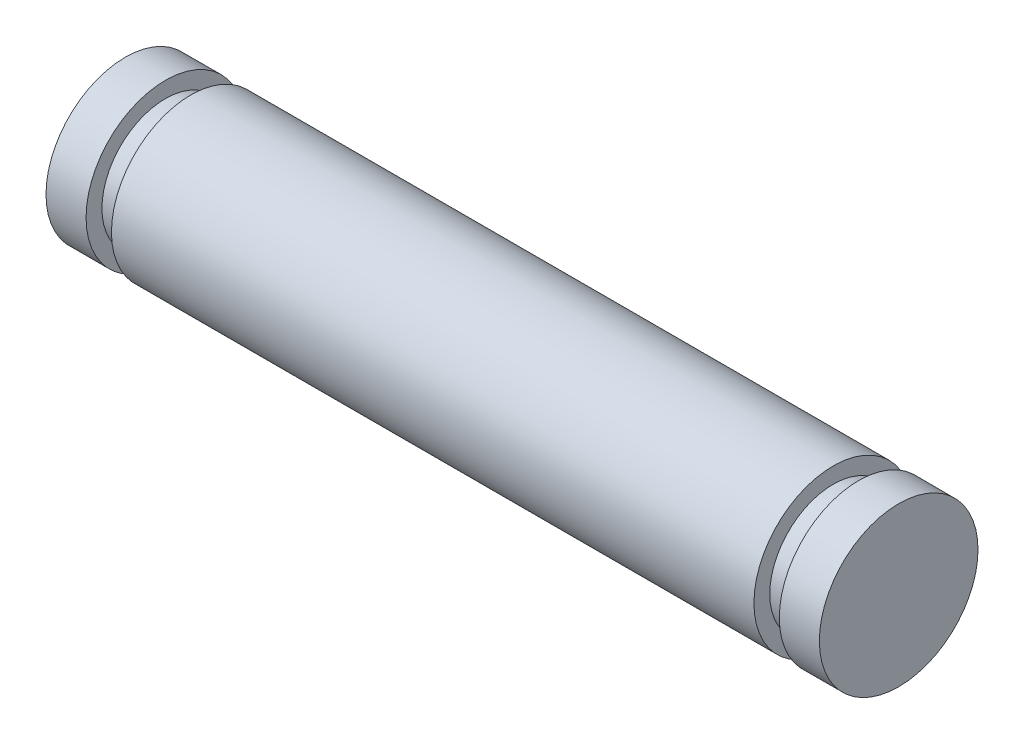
ISO-10303-21;
HEADER;
FILE_DESCRIPTION(('STEP AP214'),'2;1');
FILE_NAME('part.step','',(''),(''),'','','');
FILE_SCHEMA(('AUTOMOTIVE_DESIGN { 1 0 10303 214 1 1 1 1 }'));
ENDSEC;
DATA;
#1=APPLICATION_CONTEXT('core data for automotive mechanical design processes');
#2=APPLICATION_PROTOCOL_DEFINITION('international standard','automotive_design',2000,#1);
#3=PRODUCT_CONTEXT('',#1,'mechanical');
#4=PRODUCT('Part','Part','',(#3));
#5=PRODUCT_RELATED_PRODUCT_CATEGORY('part','',(#4));
#6=PRODUCT_DEFINITION_FORMATION('','',#4);
#7=PRODUCT_DEFINITION_CONTEXT('part definition',#1,'design');
#8=PRODUCT_DEFINITION('design','',#6,#7);
#9=PRODUCT_DEFINITION_SHAPE('','',#8);
#10=(LENGTH_UNIT() NAMED_UNIT(*) SI_UNIT(.MILLI.,.METRE.));
#11=(NAMED_UNIT(*) PLANE_ANGLE_UNIT() SI_UNIT($,.RADIAN.));
#12=(NAMED_UNIT(*) SI_UNIT($,.STERADIAN.) SOLID_ANGLE_UNIT());
#13=UNCERTAINTY_MEASURE_WITH_UNIT(LENGTH_MEASURE(1.E-05),#10,'distance_accuracy_value','');
#14=(GEOMETRIC_REPRESENTATION_CONTEXT(3) GLOBAL_UNCERTAINTY_ASSIGNED_CONTEXT((#13)) GLOBAL_UNIT_ASSIGNED_CONTEXT((#10,
#11,#12)) REPRESENTATION_CONTEXT('',''));
#15=CARTESIAN_POINT('',(0.,0.,0.));
#16=DIRECTION('',(0.,0.,1.));
#17=DIRECTION('',(1.,0.,0.));
#18=AXIS2_PLACEMENT_3D('',#15,#16,#17);
#19=CARTESIAN_POINT('',(9.75,0.,0.));
#20=DIRECTION('',(-1.,0.,0.));
#21=DIRECTION('',(0.,0.,1.));
#22=AXIS2_PLACEMENT_3D('',#19,#20,#21);
#23=CYLINDRICAL_SURFACE('',#22,2.);
#24=CARTESIAN_POINT('',(-8.1,0.,0.));
#25=DIRECTION('',(-1.,0.,0.));
#26=DIRECTION('',(0.,0.,1.));
#27=AXIS2_PLACEMENT_3D('',#24,#25,#26);
#28=CIRCLE('',#27,2.);
#29=CARTESIAN_POINT('',(-8.1,0.,2.));
#30=VERTEX_POINT('',#29);
#31=EDGE_CURVE('E49',#30,#30,#28,.T.);
#32=ORIENTED_EDGE('',*,*,#31,.F.);
#33=EDGE_LOOP('',(#32));
#34=FACE_BOUND('',#33,.T.);
#35=CARTESIAN_POINT('',(8.1,0.,0.));
#36=DIRECTION('',(-1.,0.,0.));
#37=DIRECTION('',(0.,0.,1.));
#38=AXIS2_PLACEMENT_3D('',#35,#36,#37);
#39=CIRCLE('',#38,2.);
#40=CARTESIAN_POINT('',(8.1,0.,2.));
#41=VERTEX_POINT('',#40);
#42=EDGE_CURVE('E61',#41,#41,#39,.T.);
#43=ORIENTED_EDGE('',*,*,#42,.T.);
#44=EDGE_LOOP('',(#43));
#45=FACE_BOUND('',#44,.T.);
#46=ADVANCED_FACE('F31',(#34,#45),#23,.T.);
#47=CARTESIAN_POINT('',(-9.75,0.,0.));
#48=DIRECTION('',(1.,0.,0.));
#49=DIRECTION('',(0.,0.,-1.));
#50=AXIS2_PLACEMENT_3D('',#47,#48,#49);
#51=CIRCLE('',#50,2.);
#52=CARTESIAN_POINT('',(-9.75,0.,-2.));
#53=VERTEX_POINT('',#52);
#54=EDGE_CURVE('E35',#53,#53,#51,.T.);
#55=ORIENTED_EDGE('',*,*,#54,.T.);
#56=EDGE_LOOP('',(#55));
#57=FACE_BOUND('',#56,.T.);
#58=CARTESIAN_POINT('',(-8.74,0.,0.));
#59=DIRECTION('',(-1.,0.,0.));
#60=DIRECTION('',(0.,0.,1.));
#61=AXIS2_PLACEMENT_3D('',#58,#59,#60);
#62=CIRCLE('',#61,2.);
#63=CARTESIAN_POINT('',(-8.74,0.,2.));
#64=VERTEX_POINT('',#63);
#65=EDGE_CURVE('E52',#64,#64,#62,.T.);
#66=ORIENTED_EDGE('',*,*,#65,.T.);
#67=EDGE_LOOP('',(#66));
#68=FACE_BOUND('',#67,.T.);
#69=ADVANCED_FACE('F33',(#57,#68),#23,.T.);
#70=CARTESIAN_POINT('',(-9.75,0.,0.));
#71=DIRECTION('',(1.,0.,0.));
#72=DIRECTION('',(0.,0.,-1.));
#73=AXIS2_PLACEMENT_3D('',#70,#71,#72);
#74=PLANE('',#73);
#75=ORIENTED_EDGE('',*,*,#54,.F.);
#76=EDGE_LOOP('',(#75));
#77=FACE_BOUND('',#76,.T.);
#78=ADVANCED_FACE('F82',(#77),#74,.F.);
#79=CARTESIAN_POINT('',(-8.74,0.,-2.));
#80=DIRECTION('',(1.,0.,0.));
#81=DIRECTION('',(0.,0.,-1.));
#82=AXIS2_PLACEMENT_3D('',#79,#80,#81);
#83=PLANE('',#82);
#84=CARTESIAN_POINT('',(-8.74,0.,0.));
#85=DIRECTION('',(-1.,0.,0.));
#86=DIRECTION('',(0.,0.,1.));
#87=AXIS2_PLACEMENT_3D('',#84,#85,#86);
#88=CIRCLE('',#87,1.6);
#89=CARTESIAN_POINT('',(-8.74,0.,1.6));
#90=VERTEX_POINT('',#89);
#91=EDGE_CURVE('E42',#90,#90,#88,.T.);
#92=ORIENTED_EDGE('',*,*,#91,.T.);
#93=EDGE_LOOP('',(#92));
#94=FACE_BOUND('',#93,.T.);
#95=ORIENTED_EDGE('',*,*,#65,.F.);
#96=EDGE_LOOP('',(#95));
#97=FACE_BOUND('',#96,.T.);
#98=ADVANCED_FACE('F87',(#94,#97),#83,.T.);
#99=CARTESIAN_POINT('',(-10.725,0.,0.));
#100=DIRECTION('',(-1.,0.,0.));
#101=DIRECTION('',(0.,0.,1.));
#102=AXIS2_PLACEMENT_3D('',#99,#100,#101);
#103=CYLINDRICAL_SURFACE('',#102,1.6);
#104=CARTESIAN_POINT('',(-8.1,0.,0.));
#105=DIRECTION('',(-1.,0.,0.));
#106=DIRECTION('',(0.,0.,1.));
#107=AXIS2_PLACEMENT_3D('',#104,#105,#106);
#108=CIRCLE('',#107,1.6);
#109=CARTESIAN_POINT('',(-8.1,0.,1.6));
#110=VERTEX_POINT('',#109);
#111=EDGE_CURVE('E46',#110,#110,#108,.T.);
#112=ORIENTED_EDGE('',*,*,#111,.T.);
#113=EDGE_LOOP('',(#112));
#114=FACE_BOUND('',#113,.T.);
#115=ORIENTED_EDGE('',*,*,#91,.F.);
#116=EDGE_LOOP('',(#115));
#117=FACE_BOUND('',#116,.T.);
#118=ADVANCED_FACE('F94',(#114,#117),#103,.T.);
#119=CARTESIAN_POINT('',(-8.1,0.,-2.));
#120=DIRECTION('',(-1.,0.,0.));
#121=DIRECTION('',(0.,0.,1.));
#122=AXIS2_PLACEMENT_3D('',#119,#120,#121);
#123=PLANE('',#122);
#124=ORIENTED_EDGE('',*,*,#31,.T.);
#125=EDGE_LOOP('',(#124));
#126=FACE_BOUND('',#125,.T.);
#127=ORIENTED_EDGE('',*,*,#111,.F.);
#128=EDGE_LOOP('',(#127));
#129=FACE_BOUND('',#128,.T.);
#130=ADVANCED_FACE('F100',(#126,#129),#123,.T.);
#131=CARTESIAN_POINT('',(8.74,0.,-2.));
#132=DIRECTION('',(-1.,0.,0.));
#133=DIRECTION('',(0.,0.,-1.));
#134=AXIS2_PLACEMENT_3D('',#131,#132,#133);
#135=PLANE('',#134);
#136=CARTESIAN_POINT('',(8.74,0.,0.));
#137=DIRECTION('',(-1.,0.,0.));
#138=DIRECTION('',(0.,0.,1.));
#139=AXIS2_PLACEMENT_3D('',#136,#137,#138);
#140=CIRCLE('',#139,1.6);
#141=CARTESIAN_POINT('',(8.74,0.,1.6));
#142=VERTEX_POINT('',#141);
#143=EDGE_CURVE('E55',#142,#142,#140,.T.);
#144=ORIENTED_EDGE('',*,*,#143,.F.);
#145=EDGE_LOOP('',(#144));
#146=FACE_BOUND('',#145,.T.);
#147=CARTESIAN_POINT('',(8.74,0.,0.));
#148=DIRECTION('',(-1.,0.,0.));
#149=DIRECTION('',(0.,0.,1.));
#150=AXIS2_PLACEMENT_3D('',#147,#148,#149);
#151=CIRCLE('',#150,2.);
#152=CARTESIAN_POINT('',(8.74,0.,2.));
#153=VERTEX_POINT('',#152);
#154=EDGE_CURVE('E64',#153,#153,#151,.T.);
#155=ORIENTED_EDGE('',*,*,#154,.T.);
#156=EDGE_LOOP('',(#155));
#157=FACE_BOUND('',#156,.T.);
#158=ADVANCED_FACE('F68',(#146,#157),#135,.T.);
#159=CARTESIAN_POINT('',(10.725,0.,0.));
#160=DIRECTION('',(1.,0.,0.));
#161=DIRECTION('',(0.,0.,1.));
#162=AXIS2_PLACEMENT_3D('',#159,#160,#161);
#163=CYLINDRICAL_SURFACE('',#162,1.6);
#164=CARTESIAN_POINT('',(8.1,0.,0.));
#165=DIRECTION('',(-1.,0.,0.));
#166=DIRECTION('',(0.,0.,1.));
#167=AXIS2_PLACEMENT_3D('',#164,#165,#166);
#168=CIRCLE('',#167,1.6);
#169=CARTESIAN_POINT('',(8.1,0.,1.6));
#170=VERTEX_POINT('',#169);
#171=EDGE_CURVE('E58',#170,#170,#168,.T.);
#172=ORIENTED_EDGE('',*,*,#171,.F.);
#173=EDGE_LOOP('',(#172));
#174=FACE_BOUND('',#173,.T.);
#175=ORIENTED_EDGE('',*,*,#143,.T.);
#176=EDGE_LOOP('',(#175));
#177=FACE_BOUND('',#176,.T.);
#178=ADVANCED_FACE('F109',(#174,#177),#163,.T.);
#179=CARTESIAN_POINT('',(8.1,0.,-2.));
#180=DIRECTION('',(1.,0.,0.));
#181=DIRECTION('',(0.,0.,1.));
#182=AXIS2_PLACEMENT_3D('',#179,#180,#181);
#183=PLANE('',#182);
#184=ORIENTED_EDGE('',*,*,#42,.F.);
#185=EDGE_LOOP('',(#184));
#186=FACE_BOUND('',#185,.T.);
#187=ORIENTED_EDGE('',*,*,#171,.T.);
#188=EDGE_LOOP('',(#187));
#189=FACE_BOUND('',#188,.T.);
#190=ADVANCED_FACE('F77',(#186,#189),#183,.T.);
#191=CARTESIAN_POINT('',(9.75,0.,0.));
#192=DIRECTION('',(1.,0.,0.));
#193=DIRECTION('',(0.,0.,-1.));
#194=AXIS2_PLACEMENT_3D('',#191,#192,#193);
#195=PLANE('',#194);
#196=CARTESIAN_POINT('',(9.75,0.,0.));
#197=DIRECTION('',(1.,0.,0.));
#198=DIRECTION('',(0.,0.,-1.));
#199=AXIS2_PLACEMENT_3D('',#196,#197,#198);
#200=CIRCLE('',#199,2.);
#201=CARTESIAN_POINT('',(9.75,0.,-2.));
#202=VERTEX_POINT('',#201);
#203=EDGE_CURVE('E10',#202,#202,#200,.T.);
#204=ORIENTED_EDGE('',*,*,#203,.T.);
#205=EDGE_LOOP('',(#204));
#206=FACE_BOUND('',#205,.T.);
#207=ADVANCED_FACE('F72',(#206),#195,.T.);
#208=ORIENTED_EDGE('',*,*,#203,.F.);
#209=EDGE_LOOP('',(#208));
#210=FACE_BOUND('',#209,.T.);
#211=ORIENTED_EDGE('',*,*,#154,.F.);
#212=EDGE_LOOP('',(#211));
#213=FACE_BOUND('',#212,.T.);
#214=ADVANCED_FACE('F70',(#210,#213),#23,.T.);
#215=CLOSED_SHELL('',(#46,#69,#78,#98,#118,#130,#158,#178,#190,#207,#214));
#216=MANIFOLD_SOLID_BREP('B2',#215);
#217=ADVANCED_BREP_SHAPE_REPRESENTATION('',(#18,#216),#14);
#218=SHAPE_DEFINITION_REPRESENTATION(#9,#217);
ENDSEC;
END-ISO-10303-21;
